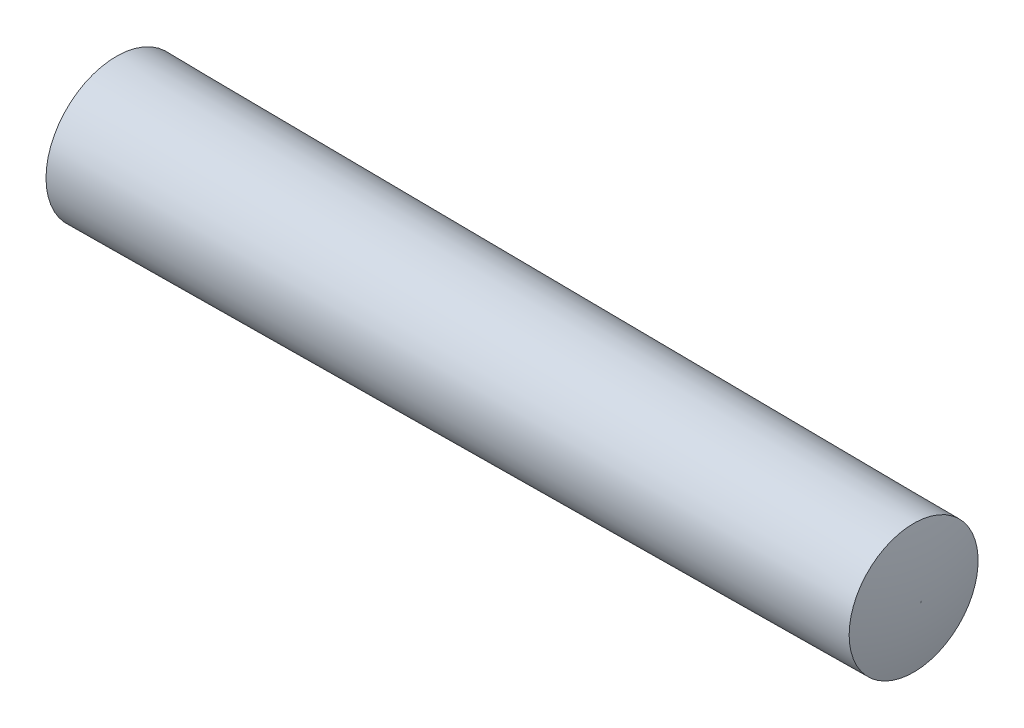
ISO-10303-21;
HEADER;
FILE_DESCRIPTION(('STEP AP214'),'2;1');
FILE_NAME('part.step','',(''),(''),'','','');
FILE_SCHEMA(('AUTOMOTIVE_DESIGN { 1 0 10303 214 1 1 1 1 }'));
ENDSEC;
DATA;
#1=APPLICATION_CONTEXT('core data for automotive mechanical design processes');
#2=APPLICATION_PROTOCOL_DEFINITION('international standard','automotive_design',2000,#1);
#3=PRODUCT_CONTEXT('',#1,'mechanical');
#4=PRODUCT('Part','Part','',(#3));
#5=PRODUCT_RELATED_PRODUCT_CATEGORY('part','',(#4));
#6=PRODUCT_DEFINITION_FORMATION('','',#4);
#7=PRODUCT_DEFINITION_CONTEXT('part definition',#1,'design');
#8=PRODUCT_DEFINITION('design','',#6,#7);
#9=PRODUCT_DEFINITION_SHAPE('','',#8);
#10=(LENGTH_UNIT() NAMED_UNIT(*) SI_UNIT(.MILLI.,.METRE.));
#11=(NAMED_UNIT(*) PLANE_ANGLE_UNIT() SI_UNIT($,.RADIAN.));
#12=(NAMED_UNIT(*) SI_UNIT($,.STERADIAN.) SOLID_ANGLE_UNIT());
#13=UNCERTAINTY_MEASURE_WITH_UNIT(LENGTH_MEASURE(1.E-05),#10,'distance_accuracy_value','');
#14=(GEOMETRIC_REPRESENTATION_CONTEXT(3) GLOBAL_UNCERTAINTY_ASSIGNED_CONTEXT((#13)) GLOBAL_UNIT_ASSIGNED_CONTEXT((#10,
#11,#12)) REPRESENTATION_CONTEXT('',''));
#15=CARTESIAN_POINT('',(0.,0.,0.));
#16=DIRECTION('',(0.,0.,1.));
#17=DIRECTION('',(1.,0.,0.));
#18=AXIS2_PLACEMENT_3D('',#15,#16,#17);
#19=CARTESIAN_POINT('',(103.649304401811,0.,0.));
#20=DIRECTION('',(-1.,0.,0.));
#21=DIRECTION('',(0.,0.,1.));
#22=AXIS2_PLACEMENT_3D('',#19,#20,#21);
#23=PLANE('',#22);
#24=CARTESIAN_POINT('',(103.649304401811,0.,0.));
#25=DIRECTION('',(-1.,0.,0.));
#26=DIRECTION('',(0.,0.,1.));
#27=AXIS2_PLACEMENT_3D('',#24,#25,#26);
#28=CIRCLE('',#27,0.0896620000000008);
#29=CARTESIAN_POINT('',(103.649304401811,0.,0.0896620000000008));
#30=VERTEX_POINT('',#29);
#31=EDGE_CURVE('E10',#30,#30,#28,.T.);
#32=ORIENTED_EDGE('',*,*,#31,.F.);
#33=EDGE_LOOP('',(#32));
#34=FACE_BOUND('',#33,.T.);
#35=ADVANCED_FACE('F31',(#34),#23,.F.);
#36=CARTESIAN_POINT('',(67.7845044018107,0.,0.));
#37=DIRECTION('',(-1.,0.,0.));
#38=DIRECTION('',(0.,0.,1.));
#39=AXIS2_PLACEMENT_3D('',#36,#37,#38);
#40=DEGENERATE_TOROIDAL_SURFACE('',#39,0.0896620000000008,35.8648,.T.);
#41=CARTESIAN_POINT('',(102.715829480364,0.,0.));
#42=DIRECTION('',(-1.,0.,0.));
#43=DIRECTION('',(0.,0.,1.));
#44=AXIS2_PLACEMENT_3D('',#41,#42,#43);
#45=CIRCLE('',#44,8.21901666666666);
#46=CARTESIAN_POINT('',(102.715829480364,0.,8.21901666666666));
#47=VERTEX_POINT('',#46);
#48=EDGE_CURVE('E37',#47,#47,#45,.T.);
#49=ORIENTED_EDGE('',*,*,#48,.F.);
#50=EDGE_LOOP('',(#49));
#51=FACE_BOUND('',#50,.T.);
#52=ORIENTED_EDGE('',*,*,#31,.T.);
#53=EDGE_LOOP('',(#52));
#54=FACE_BOUND('',#53,.T.);
#55=ADVANCED_FACE('F61',(#51,#54),#40,.T.);
#56=CARTESIAN_POINT('',(102.715829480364,0.,0.));
#57=DIRECTION('',(-1.,0.,0.));
#58=DIRECTION('',(0.,0.,1.));
#59=AXIS2_PLACEMENT_3D('',#56,#57,#58);
#60=CONICAL_SURFACE('',#59,8.21901666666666,0.00735403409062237);
#61=CARTESIAN_POINT('',(1.11582948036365,0.,0.));
#62=DIRECTION('',(-1.,0.,0.));
#63=DIRECTION('',(0.,0.,1.));
#64=AXIS2_PLACEMENT_3D('',#61,#62,#63);
#65=CIRCLE('',#64,8.9662);
#66=CARTESIAN_POINT('',(1.11582948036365,0.,8.9662));
#67=VERTEX_POINT('',#66);
#68=EDGE_CURVE('E41',#67,#67,#65,.T.);
#69=ORIENTED_EDGE('',*,*,#68,.F.);
#70=EDGE_LOOP('',(#69));
#71=FACE_BOUND('',#70,.T.);
#72=ORIENTED_EDGE('',*,*,#48,.T.);
#73=EDGE_LOOP('',(#72));
#74=FACE_BOUND('',#73,.T.);
#75=ADVANCED_FACE('F56',(#71,#74),#60,.T.);
#76=CARTESIAN_POINT('',(35.8648,0.,0.));
#77=DIRECTION('',(-1.,0.,0.));
#78=DIRECTION('',(0.,0.,1.));
#79=AXIS2_PLACEMENT_3D('',#76,#77,#78);
#80=DEGENERATE_TOROIDAL_SURFACE('',#79,0.089662,35.8648,.T.);
#81=CARTESIAN_POINT('',(0.,0.,0.));
#82=DIRECTION('',(-1.,0.,0.));
#83=DIRECTION('',(0.,0.,1.));
#84=AXIS2_PLACEMENT_3D('',#81,#82,#83);
#85=CIRCLE('',#84,0.089662);
#86=CARTESIAN_POINT('',(0.,0.,0.089662));
#87=VERTEX_POINT('',#86);
#88=EDGE_CURVE('E45',#87,#87,#85,.T.);
#89=ORIENTED_EDGE('',*,*,#88,.F.);
#90=EDGE_LOOP('',(#89));
#91=FACE_BOUND('',#90,.T.);
#92=ORIENTED_EDGE('',*,*,#68,.T.);
#93=EDGE_LOOP('',(#92));
#94=FACE_BOUND('',#93,.T.);
#95=ADVANCED_FACE('F53',(#91,#94),#80,.T.);
#96=CARTESIAN_POINT('',(0.,0.,0.));
#97=DIRECTION('',(1.,0.,0.));
#98=DIRECTION('',(0.,0.,-1.));
#99=AXIS2_PLACEMENT_3D('',#96,#97,#98);
#100=PLANE('',#99);
#101=ORIENTED_EDGE('',*,*,#88,.T.);
#102=EDGE_LOOP('',(#101));
#103=FACE_BOUND('',#102,.T.);
#104=ADVANCED_FACE('F51',(#103),#100,.F.);
#105=CLOSED_SHELL('',(#35,#55,#75,#95,#104));
#106=MANIFOLD_SOLID_BREP('B2',#105);
#107=ADVANCED_BREP_SHAPE_REPRESENTATION('',(#18,#106),#14);
#108=SHAPE_DEFINITION_REPRESENTATION(#9,#107);
ENDSEC;
END-ISO-10303-21;
